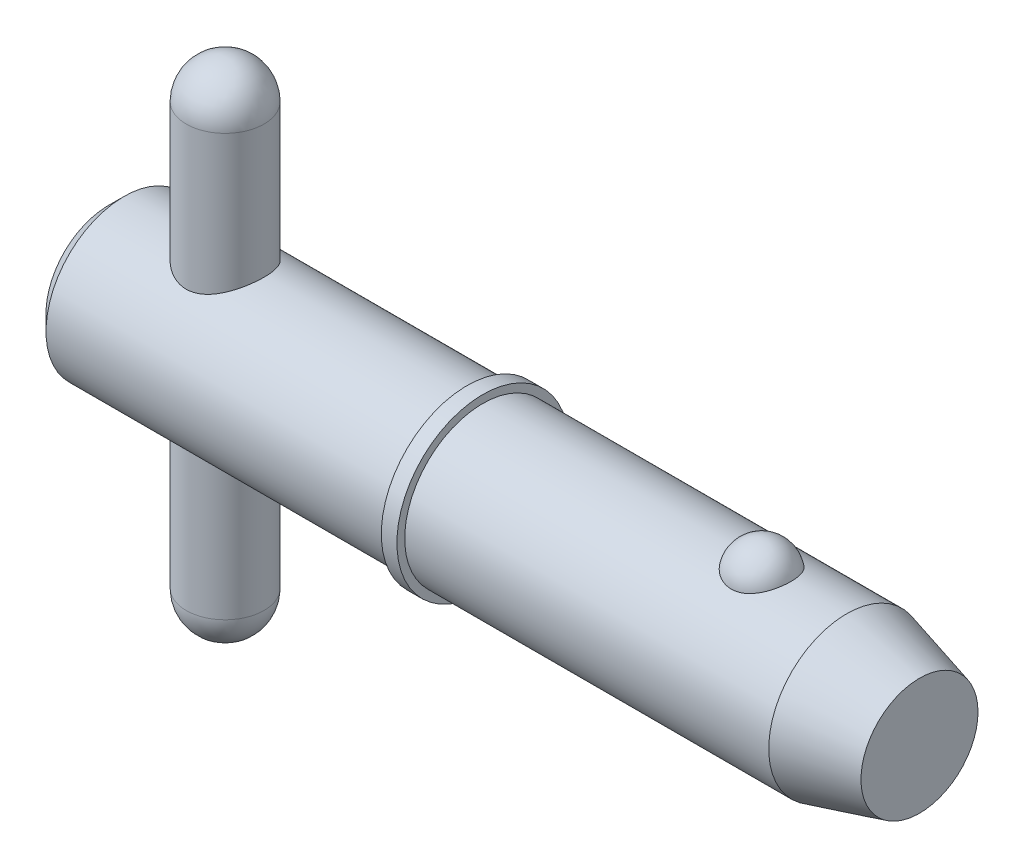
ISO-10303-21;
HEADER;
FILE_DESCRIPTION(('STEP AP214'),'2;1');
FILE_NAME('part.step','',(''),(''),'','','');
FILE_SCHEMA(('AUTOMOTIVE_DESIGN { 1 0 10303 214 1 1 1 1 }'));
ENDSEC;
DATA;
#1=APPLICATION_CONTEXT('core data for automotive mechanical design processes');
#2=APPLICATION_PROTOCOL_DEFINITION('international standard','automotive_design',2000,#1);
#3=PRODUCT_CONTEXT('',#1,'mechanical');
#4=PRODUCT('Part','Part','',(#3));
#5=PRODUCT_RELATED_PRODUCT_CATEGORY('part','',(#4));
#6=PRODUCT_DEFINITION_FORMATION('','',#4);
#7=PRODUCT_DEFINITION_CONTEXT('part definition',#1,'design');
#8=PRODUCT_DEFINITION('design','',#6,#7);
#9=PRODUCT_DEFINITION_SHAPE('','',#8);
#10=(LENGTH_UNIT() NAMED_UNIT(*) SI_UNIT(.MILLI.,.METRE.));
#11=(NAMED_UNIT(*) PLANE_ANGLE_UNIT() SI_UNIT($,.RADIAN.));
#12=(NAMED_UNIT(*) SI_UNIT($,.STERADIAN.) SOLID_ANGLE_UNIT());
#13=UNCERTAINTY_MEASURE_WITH_UNIT(LENGTH_MEASURE(1.E-05),#10,'distance_accuracy_value','');
#14=(GEOMETRIC_REPRESENTATION_CONTEXT(3) GLOBAL_UNCERTAINTY_ASSIGNED_CONTEXT((#13)) GLOBAL_UNIT_ASSIGNED_CONTEXT((#10,
#11,#12)) REPRESENTATION_CONTEXT('',''));
#15=CARTESIAN_POINT('',(0.,0.,0.));
#16=DIRECTION('',(0.,0.,1.));
#17=DIRECTION('',(1.,0.,0.));
#18=AXIS2_PLACEMENT_3D('',#15,#16,#17);
#19=CARTESIAN_POINT('',(5.94,12.7,0.));
#20=DIRECTION('',(0.,-1.,0.));
#21=DIRECTION('',(0.,0.,-1.));
#22=AXIS2_PLACEMENT_3D('',#19,#20,#21);
#23=CYLINDRICAL_SURFACE('',#22,1.98);
#24=CARTESIAN_POINT('',(5.94,-10.72,0.));
#25=DIRECTION('',(0.,-1.,0.));
#26=DIRECTION('',(0.,0.,-1.));
#27=AXIS2_PLACEMENT_3D('',#24,#25,#26);
#28=CIRCLE('',#27,1.98);
#29=CARTESIAN_POINT('',(5.94,-10.72,-1.98));
#30=VERTEX_POINT('',#29);
#31=EDGE_CURVE('P0_E10',#30,#30,#28,.F.);
#32=ORIENTED_EDGE('',*,*,#31,.T.);
#33=EDGE_LOOP('',(#32));
#34=FACE_BOUND('',#33,.T.);
#35=CARTESIAN_POINT('',(5.94,10.72,0.));
#36=DIRECTION('',(0.,-1.,0.));
#37=DIRECTION('',(0.,0.,-1.));
#38=AXIS2_PLACEMENT_3D('',#35,#36,#37);
#39=CIRCLE('',#38,1.98);
#40=CARTESIAN_POINT('',(5.94,10.72,-1.98));
#41=VERTEX_POINT('',#40);
#42=EDGE_CURVE('P0_E21',#41,#41,#39,.T.);
#43=ORIENTED_EDGE('',*,*,#42,.T.);
#44=EDGE_LOOP('',(#43));
#45=FACE_BOUND('',#44,.T.);
#46=ADVANCED_FACE('P0_F14',(#34,#45),#23,.T.);
#47=CARTESIAN_POINT('',(5.94,-10.72,0.));
#48=DIRECTION('',(0.,0.,1.));
#49=DIRECTION('',(1.,0.,0.));
#50=AXIS2_PLACEMENT_3D('',#47,#48,#49);
#51=SPHERICAL_SURFACE('',#50,1.98);
#52=CARTESIAN_POINT('',(5.94,-10.72,0.));
#53=DIRECTION('',(0.,-1.,0.));
#54=DIRECTION('',(0.,0.,-1.));
#55=AXIS2_PLACEMENT_3D('',#52,#53,#54);
#56=SPHERICAL_SURFACE('',#55,1.98);
#57=ORIENTED_EDGE('',*,*,#31,.F.);
#58=EDGE_LOOP('',(#57));
#59=FACE_BOUND('',#58,.T.);
#60=ADVANCED_FACE('P0_F29',(#59),#56,.T.);
#61=CARTESIAN_POINT('',(5.94,10.72,0.));
#62=DIRECTION('',(0.,0.,1.));
#63=DIRECTION('',(1.,0.,0.));
#64=AXIS2_PLACEMENT_3D('',#61,#62,#63);
#65=SPHERICAL_SURFACE('',#64,1.98);
#66=CARTESIAN_POINT('',(5.94,10.72,0.));
#67=DIRECTION('',(0.,-1.,0.));
#68=DIRECTION('',(0.,0.,-1.));
#69=AXIS2_PLACEMENT_3D('',#66,#67,#68);
#70=SPHERICAL_SURFACE('',#69,1.98);
#71=ORIENTED_EDGE('',*,*,#42,.F.);
#72=EDGE_LOOP('',(#71));
#73=FACE_BOUND('',#72,.T.);
#74=ADVANCED_FACE('P0_F16',(#73),#70,.T.);
#75=CLOSED_SHELL('',(#46,#60,#74));
#76=MANIFOLD_SOLID_BREP('P0_B1',#75);
#77=CARTESIAN_POINT('',(0.,0.,0.));
#78=DIRECTION('',(1.,0.,0.));
#79=DIRECTION('',(0.,0.,-1.));
#80=AXIS2_PLACEMENT_3D('',#77,#78,#79);
#81=CYLINDRICAL_SURFACE('',#80,3.97);
#82=CARTESIAN_POINT('',(37.5759395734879,0.,0.));
#83=DIRECTION('',(1.,0.,0.));
#84=DIRECTION('',(0.,0.,-1.));
#85=AXIS2_PLACEMENT_3D('',#82,#83,#84);
#86=CIRCLE('',#85,3.97);
#87=CARTESIAN_POINT('',(37.5759395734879,0.,-3.97));
#88=VERTEX_POINT('',#87);
#89=EDGE_CURVE('P1_E81',#88,#88,#86,.T.);
#90=ORIENTED_EDGE('',*,*,#89,.F.);
#91=EDGE_LOOP('',(#90));
#92=FACE_BOUND('',#91,.T.);
#93=CARTESIAN_POINT('',(19.05,0.,0.));
#94=DIRECTION('',(1.,0.,0.));
#95=DIRECTION('',(0.,0.,-1.));
#96=AXIS2_PLACEMENT_3D('',#93,#94,#95);
#97=CIRCLE('',#96,3.97);
#98=CARTESIAN_POINT('',(19.05,0.,-3.97));
#99=VERTEX_POINT('',#98);
#100=EDGE_CURVE('P1_E85',#99,#99,#97,.T.);
#101=ORIENTED_EDGE('',*,*,#100,.T.);
#102=EDGE_LOOP('',(#101));
#103=FACE_BOUND('',#102,.T.);
#104=CARTESIAN_POINT('',(33.2451922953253,3.65715365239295,1.54470941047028));
#105=CARTESIAN_POINT('',(33.1652448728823,3.65716001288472,1.54470290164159));
#106=CARTESIAN_POINT('',(33.0851650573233,3.65987074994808,1.53832549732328));
#107=CARTESIAN_POINT('',(32.9272374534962,3.6704221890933,1.51297018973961));
#108=CARTESIAN_POINT('',(32.8493961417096,3.67827646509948,1.49395894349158));
#109=CARTESIAN_POINT('',(32.6984614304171,3.69818848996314,1.44395950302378));
#110=CARTESIAN_POINT('',(32.6253560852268,3.71023513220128,1.41300293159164));
#111=CARTESIAN_POINT('',(32.4855630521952,3.7372183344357,1.34000212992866));
#112=CARTESIAN_POINT('',(32.4188725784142,3.75215363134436,1.29796274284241));
#113=CARTESIAN_POINT('',(32.2914886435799,3.78384968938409,1.20248834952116));
#114=CARTESIAN_POINT('',(32.2310299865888,3.80065129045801,1.14875388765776));
#115=CARTESIAN_POINT('',(32.1196942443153,3.83398532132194,1.03205417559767));
#116=CARTESIAN_POINT('',(32.0688200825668,3.85051766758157,0.969086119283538));
#117=CARTESIAN_POINT('',(31.9756321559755,3.88238608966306,0.832526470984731));
#118=CARTESIAN_POINT('',(31.9337961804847,3.89763698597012,0.75858832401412));
#119=CARTESIAN_POINT('',(31.8625108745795,3.92451063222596,0.604352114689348));
#120=CARTESIAN_POINT('',(31.8330623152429,3.93613315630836,0.524053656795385));
#121=CARTESIAN_POINT('',(31.7868927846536,3.95467606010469,0.358403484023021));
#122=CARTESIAN_POINT('',(31.7703127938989,3.96154426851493,0.273006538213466));
#123=CARTESIAN_POINT('',(31.750756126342,3.96967008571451,0.100408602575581));
#124=CARTESIAN_POINT('',(31.7477789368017,3.97092790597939,0.0132076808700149));
#125=CARTESIAN_POINT('',(31.7554587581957,3.96771794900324,-0.159844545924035));
#126=CARTESIAN_POINT('',(31.7660164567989,3.96329187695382,-0.245701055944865));
#127=CARTESIAN_POINT('',(31.8003800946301,3.94923163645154,-0.414277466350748));
#128=CARTESIAN_POINT('',(31.8241862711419,3.93959737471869,-0.496997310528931));
#129=CARTESIAN_POINT('',(31.8846114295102,3.91607752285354,-0.657113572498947));
#130=CARTESIAN_POINT('',(31.9212495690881,3.90218558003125,-0.734501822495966));
#131=CARTESIAN_POINT('',(32.0065935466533,3.87158287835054,-0.881704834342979));
#132=CARTESIAN_POINT('',(32.0553004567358,3.8548718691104,-0.951518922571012));
#133=CARTESIAN_POINT('',(32.1641161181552,3.82028735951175,-1.08208159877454));
#134=CARTESIAN_POINT('',(32.2242955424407,3.80240713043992,-1.14276958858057));
#135=CARTESIAN_POINT('',(32.354493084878,3.76758161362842,-1.2528243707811));
#136=CARTESIAN_POINT('',(32.4245105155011,3.75063626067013,-1.30219195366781));
#137=CARTESIAN_POINT('',(32.57118160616,3.71998948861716,-1.38729709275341));
#138=CARTESIAN_POINT('',(32.6476813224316,3.70623183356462,-1.42327904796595));
#139=CARTESIAN_POINT('',(32.8062981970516,3.68323188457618,-1.48178996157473));
#140=CARTESIAN_POINT('',(32.8884132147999,3.67398788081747,-1.5043240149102));
#141=CARTESIAN_POINT('',(33.0514810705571,3.6615216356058,-1.53440939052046));
#142=CARTESIAN_POINT('',(33.1322840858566,3.65801951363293,-1.54265826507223));
#143=CARTESIAN_POINT('',(33.2942085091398,3.65657341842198,-1.5460842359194));
#144=CARTESIAN_POINT('',(33.3753298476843,3.65862829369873,-1.54126404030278));
#145=CARTESIAN_POINT('',(33.5328122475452,3.66788969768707,-1.51908474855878));
#146=CARTESIAN_POINT('',(33.6092422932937,3.67492621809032,-1.50213925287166));
#147=CARTESIAN_POINT('',(33.7580412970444,3.69318404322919,-1.45666982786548));
#148=CARTESIAN_POINT('',(33.8304099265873,3.70440568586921,-1.42814496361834));
#149=CARTESIAN_POINT('',(33.9708029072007,3.73012749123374,-1.35956319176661));
#150=CARTESIAN_POINT('',(34.0387000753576,3.74469307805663,-1.31927107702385));
#151=CARTESIAN_POINT('',(34.1668649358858,3.77545272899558,-1.22847440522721));
#152=CARTESIAN_POINT('',(34.2271308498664,3.79164717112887,-1.17796747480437));
#153=CARTESIAN_POINT('',(34.3416346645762,3.82490325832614,-1.06519260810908));
#154=CARTESIAN_POINT('',(34.3954137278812,3.84196735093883,-1.00245914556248));
#155=CARTESIAN_POINT('',(34.4920988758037,3.87439863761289,-0.868715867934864));
#156=CARTESIAN_POINT('',(34.5350030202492,3.88976552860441,-0.797704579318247));
#157=CARTESIAN_POINT('',(34.610266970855,3.91771381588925,-0.646896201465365));
#158=CARTESIAN_POINT('',(34.6422532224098,3.93019255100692,-0.566893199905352));
#159=CARTESIAN_POINT('',(34.6931101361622,3.95043886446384,-0.40225513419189));
#160=CARTESIAN_POINT('',(34.7119807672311,3.95820643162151,-0.317620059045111));
#161=CARTESIAN_POINT('',(34.7362162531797,3.96823733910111,-0.14615699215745));
#162=CARTESIAN_POINT('',(34.7415874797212,3.970503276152,-0.0593300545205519));
#163=CARTESIAN_POINT('',(34.7387309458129,3.96930811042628,0.114057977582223));
#164=CARTESIAN_POINT('',(34.7305035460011,3.9658471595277,0.200619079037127));
#165=CARTESIAN_POINT('',(34.7007063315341,3.95358562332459,0.370506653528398));
#166=CARTESIAN_POINT('',(34.6792129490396,3.94481563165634,0.453848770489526));
#167=CARTESIAN_POINT('',(34.6233839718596,3.92284586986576,0.615497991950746));
#168=CARTESIAN_POINT('',(34.5890474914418,3.90964579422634,0.693804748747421));
#169=CARTESIAN_POINT('',(34.5079702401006,3.88006987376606,0.843703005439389));
#170=CARTESIAN_POINT('',(34.4611536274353,3.86367478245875,0.915249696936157));
#171=CARTESIAN_POINT('',(34.3561897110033,3.82949741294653,1.04910810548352));
#172=CARTESIAN_POINT('',(34.2980428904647,3.81171519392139,1.11142021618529));
#173=CARTESIAN_POINT('',(34.1717433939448,3.77673366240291,1.22503948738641));
#174=CARTESIAN_POINT('',(34.1035970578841,3.75953398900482,1.27635357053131));
#175=CARTESIAN_POINT('',(33.9589009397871,3.72770506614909,1.36653336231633));
#176=CARTESIAN_POINT('',(33.882348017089,3.71307678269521,1.40539439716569));
#177=CARTESIAN_POINT('',(33.7257594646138,3.68864287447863,1.46830480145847));
#178=CARTESIAN_POINT('',(33.6459307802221,3.67869017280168,1.49281289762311));
#179=CARTESIAN_POINT('',(33.4829877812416,3.66414535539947,1.52817474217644));
#180=CARTESIAN_POINT('',(33.3998840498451,3.65953723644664,1.53906926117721));
#181=CARTESIAN_POINT('',(33.2927760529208,3.6573894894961,1.54414878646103));
#182=CARTESIAN_POINT('',(33.2689900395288,3.65715175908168,1.54471134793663));
#183=CARTESIAN_POINT('',(33.2451922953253,3.65715365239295,1.54470941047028));
#184=B_SPLINE_CURVE_WITH_KNOTS('',3,(#104,#105,#106,#107,#108,#109,#110,#111,#112,#113,#114,
#115,#116,#117,#118,#119,#120,#121,#122,#123,#124,#125,#126,#127,#128,#129,#130,#131,#132,#133,
#134,#135,#136,#137,#138,#139,#140,#141,#142,#143,#144,#145,#146,#147,#148,#149,#150,#151,#152,
#153,#154,#155,#156,#157,#158,#159,#160,#161,#162,#163,#164,#165,#166,#167,#168,#169,#170,#171,
#172,#173,#174,#175,#176,#177,#178,#179,#180,#181,#182,#183),.UNSPECIFIED.,.T.,.F.,(4,2,2,2,2,2,
2,2,2,2,2,2,2,2,2,2,2,2,2,2,2,2,2,2,2,2,2,2,2,2,2,2,2,2,2,2,2,2,2,4),(0.,0.239777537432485,
0.480190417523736,0.719971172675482,0.959647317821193,1.20639040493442,1.45320863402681,
1.7109367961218,1.96868099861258,2.22921052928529,2.48973023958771,2.74834928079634,
3.00697295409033,3.26598440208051,3.52501886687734,3.78570385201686,4.04637062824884,
4.30201257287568,4.55755760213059,4.80022994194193,5.04285200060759,5.27757006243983,
5.51230707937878,5.75210128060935,5.99195126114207,6.24392810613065,6.49594987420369,
6.75588818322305,7.01582710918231,7.27564332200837,7.53545264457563,7.79377886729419,
8.0521229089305,8.31207418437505,8.57201437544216,8.83179046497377,9.09166393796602,
9.34270057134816,9.59298357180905,9.66435753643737),.UNSPECIFIED.);
#185=CARTESIAN_POINT('',(33.2451922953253,3.65715365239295,1.54470941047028));
#186=VERTEX_POINT('',#185);
#187=EDGE_CURVE('P1_E35',#186,#186,#184,.T.);
#188=ORIENTED_EDGE('',*,*,#187,.T.);
#189=EDGE_LOOP('',(#188));
#190=FACE_BOUND('',#189,.T.);
#191=ADVANCED_FACE('P1_F13',(#92,#103,#190),#81,.T.);
#192=CARTESIAN_POINT('',(0.,0.,0.));
#193=DIRECTION('',(-1.,0.,0.));
#194=DIRECTION('',(0.,0.,1.));
#195=AXIS2_PLACEMENT_3D('',#192,#193,#194);
#196=PLANE('',#195);
#197=CARTESIAN_POINT('',(0.,0.,0.));
#198=DIRECTION('',(1.,0.,0.));
#199=DIRECTION('',(0.,0.,-1.));
#200=AXIS2_PLACEMENT_3D('',#197,#198,#199);
#201=CIRCLE('',#200,3.176);
#202=CARTESIAN_POINT('',(0.,0.,-3.176));
#203=VERTEX_POINT('',#202);
#204=EDGE_CURVE('P1_E9',#203,#203,#201,.T.);
#205=ORIENTED_EDGE('',*,*,#204,.F.);
#206=EDGE_LOOP('',(#205));
#207=FACE_BOUND('',#206,.T.);
#208=ADVANCED_FACE('P1_F15',(#207),#196,.T.);
#209=CARTESIAN_POINT('',(0.793999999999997,0.,0.));
#210=DIRECTION('',(1.,0.,0.));
#211=DIRECTION('',(0.,0.,-1.));
#212=AXIS2_PLACEMENT_3D('',#209,#210,#211);
#213=CONICAL_SURFACE('',#212,3.97,0.78539816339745);
#214=ORIENTED_EDGE('',*,*,#204,.T.);
#215=EDGE_LOOP('',(#214));
#216=FACE_BOUND('',#215,.T.);
#217=CARTESIAN_POINT('',(0.793999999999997,0.,0.));
#218=DIRECTION('',(1.,0.,0.));
#219=DIRECTION('',(0.,0.,-1.));
#220=AXIS2_PLACEMENT_3D('',#217,#218,#219);
#221=CIRCLE('',#220,3.97);
#222=CARTESIAN_POINT('',(0.793999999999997,0.,-3.97));
#223=VERTEX_POINT('',#222);
#224=EDGE_CURVE('P1_E26',#223,#223,#221,.T.);
#225=ORIENTED_EDGE('',*,*,#224,.F.);
#226=EDGE_LOOP('',(#225));
#227=FACE_BOUND('',#226,.T.);
#228=ADVANCED_FACE('P1_F77',(#216,#227),#213,.T.);
#229=CARTESIAN_POINT('',(0.,0.,0.));
#230=DIRECTION('',(1.,0.,0.));
#231=DIRECTION('',(0.,0.,-1.));
#232=AXIS2_PLACEMENT_3D('',#229,#230,#231);
#233=CYLINDRICAL_SURFACE('',#232,3.97);
#234=CARTESIAN_POINT('',(5.94,-3.44100276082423,1.98));
#235=CARTESIAN_POINT('',(5.8367885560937,-3.44101282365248,1.97999171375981));
#236=CARTESIAN_POINT('',(5.73344176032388,-3.44571749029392,1.97187534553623));
#237=CARTESIAN_POINT('',(5.52991905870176,-3.46385873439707,1.93981946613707));
#238=CARTESIAN_POINT('',(5.42975031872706,-3.47731375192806,1.91584653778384));
#239=CARTESIAN_POINT('',(5.23590869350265,-3.51100678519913,1.85336773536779));
#240=CARTESIAN_POINT('',(5.14220446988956,-3.53120882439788,1.81493880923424));
#241=CARTESIAN_POINT('',(4.9625969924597,-3.57606420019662,1.72487335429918));
#242=CARTESIAN_POINT('',(4.87669412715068,-3.6007177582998,1.67323616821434));
#243=CARTESIAN_POINT('',(4.70734412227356,-3.65417020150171,1.55325205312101));
#244=CARTESIAN_POINT('',(4.62467662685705,-3.68314323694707,1.4838818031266));
#245=CARTESIAN_POINT('',(4.47154355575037,-3.74056406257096,1.33252902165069));
#246=CARTESIAN_POINT('',(4.40108404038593,-3.76901158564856,1.25054026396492));
#247=CARTESIAN_POINT('',(4.26974803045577,-3.82445556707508,1.06956584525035));
#248=CARTESIAN_POINT('',(4.20982960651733,-3.8512271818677,0.969809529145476));
#249=CARTESIAN_POINT('',(4.10798077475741,-3.89804342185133,0.760047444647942));
#250=CARTESIAN_POINT('',(4.06603907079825,-3.91809226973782,0.650048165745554));
#251=CARTESIAN_POINT('',(4.00441878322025,-3.94794912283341,0.431181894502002));
#252=CARTESIAN_POINT('',(3.98337329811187,-3.95838209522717,0.322786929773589));
#253=CARTESIAN_POINT('',(3.9596425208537,-3.97016407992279,0.103541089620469));
#254=CARTESIAN_POINT('',(3.95694618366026,-3.97151855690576,-0.00730826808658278));
#255=CARTESIAN_POINT('',(3.9694599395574,-3.96528826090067,-0.218044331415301));
#256=CARTESIAN_POINT('',(3.98314071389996,-3.95846689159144,-0.318049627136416));
#257=CARTESIAN_POINT('',(4.02528522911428,-3.93780347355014,-0.514124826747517));
#258=CARTESIAN_POINT('',(4.05375007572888,-3.92396089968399,-0.61019443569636));
#259=CARTESIAN_POINT('',(4.12484256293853,-3.89028355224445,-0.797351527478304));
#260=CARTESIAN_POINT('',(4.16766142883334,-3.87036821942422,-0.888351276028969));
#261=CARTESIAN_POINT('',(4.26598377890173,-3.82634285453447,-1.06209448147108));
#262=CARTESIAN_POINT('',(4.32149181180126,-3.8022313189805,-1.14483496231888));
#263=CARTESIAN_POINT('',(4.44962332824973,-3.74940011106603,-1.30802500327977));
#264=CARTESIAN_POINT('',(4.52336636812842,-3.72046031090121,-1.38752498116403));
#265=CARTESIAN_POINT('',(4.68287656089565,-3.66269463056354,-1.53354043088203));
#266=CARTESIAN_POINT('',(4.7686527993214,-3.63386885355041,-1.60004599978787));
#267=CARTESIAN_POINT('',(4.9564069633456,-3.57763161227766,-1.72228426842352));
#268=CARTESIAN_POINT('',(5.05906485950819,-3.5504233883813,-1.77707534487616));
#269=CARTESIAN_POINT('',(5.27381412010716,-3.50334038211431,-1.86819784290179));
#270=CARTESIAN_POINT('',(5.38589553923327,-3.48345798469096,-1.90454844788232));
#271=CARTESIAN_POINT('',(5.6069795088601,-3.45548331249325,-1.95481643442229));
#272=CARTESIAN_POINT('',(5.71552407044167,-3.44658268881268,-1.97028113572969));
#273=CARTESIAN_POINT('',(5.93399639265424,-3.43928114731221,-1.98300600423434));
#274=CARTESIAN_POINT('',(6.04392313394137,-3.44087289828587,-1.98027888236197));
#275=CARTESIAN_POINT('',(6.24931618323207,-3.45351901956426,-1.95811780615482));
#276=CARTESIAN_POINT('',(6.34505668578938,-3.46352725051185,-1.94052989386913));
#277=CARTESIAN_POINT('',(6.53204702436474,-3.49033612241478,-1.89188242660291));
#278=CARTESIAN_POINT('',(6.62329540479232,-3.50713894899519,-1.86081853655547));
#279=CARTESIAN_POINT('',(6.80352105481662,-3.54655680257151,-1.78458666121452));
#280=CARTESIAN_POINT('',(6.89219712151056,-3.56940508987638,-1.73883178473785));
#281=CARTESIAN_POINT('',(7.06112449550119,-3.61813012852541,-1.63502913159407));
#282=CARTESIAN_POINT('',(7.14137144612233,-3.6440084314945,-1.57697504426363));
#283=CARTESIAN_POINT('',(7.30168083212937,-3.69977514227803,-1.44171920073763));
#284=CARTESIAN_POINT('',(7.38046039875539,-3.7297597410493,-1.36302972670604));
#285=CARTESIAN_POINT('',(7.52409649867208,-3.78754991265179,-1.19307190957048));
#286=CARTESIAN_POINT('',(7.58894840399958,-3.81535475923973,-1.10179940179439));
#287=CARTESIAN_POINT('',(7.70430122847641,-3.86658972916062,-0.906019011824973));
#288=CARTESIAN_POINT('',(7.75438714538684,-3.88988795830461,-0.801229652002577));
#289=CARTESIAN_POINT('',(7.83572184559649,-3.92848199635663,-0.583216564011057));
#290=CARTESIAN_POINT('',(7.86698708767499,-3.94378479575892,-0.470000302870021));
#291=CARTESIAN_POINT('',(7.90711051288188,-3.96355307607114,-0.249525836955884));
#292=CARTESIAN_POINT('',(7.91775648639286,-3.96888171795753,-0.142669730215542));
#293=CARTESIAN_POINT('',(7.92160247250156,-3.97079858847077,0.0714191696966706));
#294=CARTESIAN_POINT('',(7.91480852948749,-3.96738984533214,0.178651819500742));
#295=CARTESIAN_POINT('',(7.88515479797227,-3.9527181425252,0.383072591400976));
#296=CARTESIAN_POINT('',(7.8633739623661,-3.94198303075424,0.480459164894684));
#297=CARTESIAN_POINT('',(7.80581513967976,-3.91422178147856,0.670038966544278));
#298=CARTESIAN_POINT('',(7.77003513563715,-3.89719473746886,0.762231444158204));
#299=CARTESIAN_POINT('',(7.68389191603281,-3.85747818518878,0.943248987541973));
#300=CARTESIAN_POINT('',(7.63296879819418,-3.83457704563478,1.03175978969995));
#301=CARTESIAN_POINT('',(7.51869140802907,-3.7855122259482,1.19934744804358));
#302=CARTESIAN_POINT('',(7.45533142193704,-3.75934704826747,1.2784199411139));
#303=CARTESIAN_POINT('',(7.31068939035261,-3.70329841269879,1.433144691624));
#304=CARTESIAN_POINT('',(7.22825362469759,-3.67330340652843,1.50768183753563));
#305=CARTESIAN_POINT('',(7.05162367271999,-3.61514025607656,1.64226879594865));
#306=CARTESIAN_POINT('',(6.95741928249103,-3.58697372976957,1.70230590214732));
#307=CARTESIAN_POINT('',(6.75590859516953,-3.53504049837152,1.80775364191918));
#308=CARTESIAN_POINT('',(6.64828786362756,-3.51143624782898,1.85265616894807));
#309=CARTESIAN_POINT('',(6.48137774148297,-3.48289659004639,1.90544537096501));
#310=CARTESIAN_POINT('',(6.42488151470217,-3.4745323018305,1.9206071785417));
#311=CARTESIAN_POINT('',(6.31046920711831,-3.4604244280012,1.94591259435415));
#312=CARTESIAN_POINT('',(6.25255415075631,-3.45467900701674,1.95605971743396));
#313=CARTESIAN_POINT('',(6.1521444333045,-3.44728060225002,1.96905939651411));
#314=CARTESIAN_POINT('',(6.10985721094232,-3.44493297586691,1.97315742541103));
#315=CARTESIAN_POINT('',(6.02505433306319,-3.44179192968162,1.97862952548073));
#316=CARTESIAN_POINT('',(5.98253866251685,-3.44099861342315,1.98000341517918));
#317=CARTESIAN_POINT('',(5.94,-3.44100276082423,1.98));
#318=B_SPLINE_CURVE_WITH_KNOTS('',3,(#234,#235,#236,#237,#238,#239,#240,#241,#242,#243,#244,
#245,#246,#247,#248,#249,#250,#251,#252,#253,#254,#255,#256,#257,#258,#259,#260,#261,#262,#263,
#264,#265,#266,#267,#268,#269,#270,#271,#272,#273,#274,#275,#276,#277,#278,#279,#280,#281,#282,
#283,#284,#285,#286,#287,#288,#289,#290,#291,#292,#293,#294,#295,#296,#297,#298,#299,#300,#301,
#302,#303,#304,#305,#306,#307,#308,#309,#310,#311,#312,#313,#314,#315,#316,#317),.UNSPECIFIED.,
.T.,.F.,(4,2,2,2,2,2,2,2,2,2,2,2,2,2,2,2,2,2,2,2,2,2,2,2,2,2,2,2,2,2,2,2,2,2,2,2,2,2,2,2,2,4),
(0.,0.309462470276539,0.619579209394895,0.928068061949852,1.23657226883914,1.57038619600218,
1.90436536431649,2.26071614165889,2.61684266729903,2.94773555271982,3.27842924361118,
3.58050679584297,3.88260694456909,4.18890317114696,4.49530936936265,4.83057163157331,
5.1660884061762,5.52272472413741,5.87898927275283,6.20706708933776,6.53491569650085,
6.82716910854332,7.11951660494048,7.42541184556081,7.73146442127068,8.07586334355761,
8.42037652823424,8.77380887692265,9.12693169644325,9.44775848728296,9.76847409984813,
10.0682302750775,10.3680296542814,10.6806938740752,10.9935020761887,11.3373031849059,
11.6814044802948,12.0361164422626,12.2131519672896,12.3900632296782,12.5175998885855,
12.6451450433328),.UNSPECIFIED.);
#319=CARTESIAN_POINT('',(5.94,-3.44100276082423,1.98));
#320=VERTEX_POINT('',#319);
#321=EDGE_CURVE('P1_E17',#320,#320,#318,.T.);
#322=ORIENTED_EDGE('',*,*,#321,.F.);
#323=EDGE_LOOP('',(#322));
#324=FACE_BOUND('',#323,.T.);
#325=CARTESIAN_POINT('',(5.94,3.44100276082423,1.98));
#326=CARTESIAN_POINT('',(6.0432114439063,3.44101282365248,1.97999171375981));
#327=CARTESIAN_POINT('',(6.14655823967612,3.44571749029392,1.97187534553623));
#328=CARTESIAN_POINT('',(6.35008094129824,3.46385873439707,1.93981946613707));
#329=CARTESIAN_POINT('',(6.45024968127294,3.47731375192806,1.91584653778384));
#330=CARTESIAN_POINT('',(6.64409130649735,3.51100678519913,1.85336773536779));
#331=CARTESIAN_POINT('',(6.73779553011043,3.53120882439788,1.81493880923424));
#332=CARTESIAN_POINT('',(6.91740300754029,3.57606420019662,1.72487335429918));
#333=CARTESIAN_POINT('',(7.00330587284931,3.6007177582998,1.67323616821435));
#334=CARTESIAN_POINT('',(7.17265587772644,3.65417020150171,1.55325205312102));
#335=CARTESIAN_POINT('',(7.25532337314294,3.68314323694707,1.4838818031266));
#336=CARTESIAN_POINT('',(7.40845644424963,3.74056406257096,1.3325290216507));
#337=CARTESIAN_POINT('',(7.47891595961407,3.76901158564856,1.25054026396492));
#338=CARTESIAN_POINT('',(7.61025196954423,3.82445556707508,1.06956584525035));
#339=CARTESIAN_POINT('',(7.67017039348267,3.8512271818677,0.969809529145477));
#340=CARTESIAN_POINT('',(7.77201922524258,3.89804342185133,0.760047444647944));
#341=CARTESIAN_POINT('',(7.81396092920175,3.91809226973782,0.650048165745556));
#342=CARTESIAN_POINT('',(7.87558121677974,3.94794912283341,0.431181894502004));
#343=CARTESIAN_POINT('',(7.89662670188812,3.95838209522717,0.322786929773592));
#344=CARTESIAN_POINT('',(7.9203574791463,3.97016407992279,0.103541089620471));
#345=CARTESIAN_POINT('',(7.92305381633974,3.97151855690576,-0.00730826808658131));
#346=CARTESIAN_POINT('',(7.9105400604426,3.96528826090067,-0.2180443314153));
#347=CARTESIAN_POINT('',(7.89685928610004,3.95846689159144,-0.318049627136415));
#348=CARTESIAN_POINT('',(7.85471477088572,3.93780347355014,-0.514124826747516));
#349=CARTESIAN_POINT('',(7.82624992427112,3.92396089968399,-0.61019443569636));
#350=CARTESIAN_POINT('',(7.75515743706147,3.89028355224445,-0.797351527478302));
#351=CARTESIAN_POINT('',(7.71233857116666,3.87036821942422,-0.888351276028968));
#352=CARTESIAN_POINT('',(7.61401622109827,3.82634285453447,-1.06209448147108));
#353=CARTESIAN_POINT('',(7.55850818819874,3.8022313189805,-1.14483496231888));
#354=CARTESIAN_POINT('',(7.43037667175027,3.74940011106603,-1.30802500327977));
#355=CARTESIAN_POINT('',(7.35663363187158,3.72046031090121,-1.38752498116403));
#356=CARTESIAN_POINT('',(7.19712343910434,3.66269463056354,-1.53354043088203));
#357=CARTESIAN_POINT('',(7.1113472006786,3.63386885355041,-1.60004599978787));
#358=CARTESIAN_POINT('',(6.9235930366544,3.57763161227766,-1.72228426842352));
#359=CARTESIAN_POINT('',(6.82093514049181,3.5504233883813,-1.77707534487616));
#360=CARTESIAN_POINT('',(6.60618587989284,3.50334038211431,-1.86819784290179));
#361=CARTESIAN_POINT('',(6.49410446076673,3.48345798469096,-1.90454844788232));
#362=CARTESIAN_POINT('',(6.2730204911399,3.45548331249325,-1.95481643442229));
#363=CARTESIAN_POINT('',(6.16447592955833,3.44658268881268,-1.97028113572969));
#364=CARTESIAN_POINT('',(5.94600360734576,3.43928114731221,-1.98300600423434));
#365=CARTESIAN_POINT('',(5.83607686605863,3.44087289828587,-1.98027888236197));
#366=CARTESIAN_POINT('',(5.63068381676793,3.45351901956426,-1.95811780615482));
#367=CARTESIAN_POINT('',(5.53494331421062,3.46352725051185,-1.94052989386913));
#368=CARTESIAN_POINT('',(5.34795297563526,3.49033612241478,-1.89188242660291));
#369=CARTESIAN_POINT('',(5.25670459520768,3.50713894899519,-1.86081853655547));
#370=CARTESIAN_POINT('',(5.07647894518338,3.54655680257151,-1.78458666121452));
#371=CARTESIAN_POINT('',(4.98780287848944,3.56940508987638,-1.73883178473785));
#372=CARTESIAN_POINT('',(4.81887550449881,3.61813012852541,-1.63502913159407));
#373=CARTESIAN_POINT('',(4.73862855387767,3.6440084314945,-1.57697504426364));
#374=CARTESIAN_POINT('',(4.57831916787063,3.69977514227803,-1.44171920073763));
#375=CARTESIAN_POINT('',(4.49953960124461,3.7297597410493,-1.36302972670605));
#376=CARTESIAN_POINT('',(4.35590350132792,3.78754991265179,-1.19307190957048));
#377=CARTESIAN_POINT('',(4.29105159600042,3.81535475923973,-1.10179940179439));
#378=CARTESIAN_POINT('',(4.17569877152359,3.86658972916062,-0.906019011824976));
#379=CARTESIAN_POINT('',(4.12561285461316,3.88988795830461,-0.80122965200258));
#380=CARTESIAN_POINT('',(4.04427815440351,3.92848199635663,-0.58321656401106));
#381=CARTESIAN_POINT('',(4.01301291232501,3.94378479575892,-0.470000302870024));
#382=CARTESIAN_POINT('',(3.97288948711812,3.96355307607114,-0.249525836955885));
#383=CARTESIAN_POINT('',(3.96224351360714,3.96888171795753,-0.142669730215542));
#384=CARTESIAN_POINT('',(3.95839752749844,3.97079858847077,0.0714191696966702));
#385=CARTESIAN_POINT('',(3.96519147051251,3.96738984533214,0.178651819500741));
#386=CARTESIAN_POINT('',(3.99484520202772,3.9527181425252,0.383072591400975));
#387=CARTESIAN_POINT('',(4.01662603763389,3.94198303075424,0.480459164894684));
#388=CARTESIAN_POINT('',(4.07418486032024,3.91422178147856,0.670038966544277));
#389=CARTESIAN_POINT('',(4.10996486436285,3.89719473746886,0.762231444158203));
#390=CARTESIAN_POINT('',(4.19610808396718,3.85747818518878,0.943248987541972));
#391=CARTESIAN_POINT('',(4.24703120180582,3.83457704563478,1.03175978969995));
#392=CARTESIAN_POINT('',(4.36130859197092,3.7855122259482,1.19934744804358));
#393=CARTESIAN_POINT('',(4.42466857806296,3.75934704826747,1.2784199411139));
#394=CARTESIAN_POINT('',(4.56931060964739,3.70329841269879,1.433144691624));
#395=CARTESIAN_POINT('',(4.65174637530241,3.67330340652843,1.50768183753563));
#396=CARTESIAN_POINT('',(4.82837632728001,3.61514025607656,1.64226879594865));
#397=CARTESIAN_POINT('',(4.92258071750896,3.58697372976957,1.70230590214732));
#398=CARTESIAN_POINT('',(5.12409140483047,3.53504049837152,1.80775364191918));
#399=CARTESIAN_POINT('',(5.23171213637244,3.51143624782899,1.85265616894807));
#400=CARTESIAN_POINT('',(5.39862225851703,3.48289659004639,1.90544537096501));
#401=CARTESIAN_POINT('',(5.45511848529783,3.4745323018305,1.9206071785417));
#402=CARTESIAN_POINT('',(5.56953079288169,3.4604244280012,1.94591259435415));
#403=CARTESIAN_POINT('',(5.62744584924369,3.45467900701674,1.95605971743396));
#404=CARTESIAN_POINT('',(5.7278555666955,3.44728060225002,1.9690593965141));
#405=CARTESIAN_POINT('',(5.77014278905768,3.44493297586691,1.97315742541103));
#406=CARTESIAN_POINT('',(5.85494566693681,3.44179192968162,1.97862952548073));
#407=CARTESIAN_POINT('',(5.89746133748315,3.44099861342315,1.98000341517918));
#408=CARTESIAN_POINT('',(5.94,3.44100276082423,1.98));
#409=B_SPLINE_CURVE_WITH_KNOTS('',3,(#325,#326,#327,#328,#329,#330,#331,#332,#333,#334,#335,
#336,#337,#338,#339,#340,#341,#342,#343,#344,#345,#346,#347,#348,#349,#350,#351,#352,#353,#354,
#355,#356,#357,#358,#359,#360,#361,#362,#363,#364,#365,#366,#367,#368,#369,#370,#371,#372,#373,
#374,#375,#376,#377,#378,#379,#380,#381,#382,#383,#384,#385,#386,#387,#388,#389,#390,#391,#392,
#393,#394,#395,#396,#397,#398,#399,#400,#401,#402,#403,#404,#405,#406,#407,#408),.UNSPECIFIED.,
.T.,.F.,(4,2,2,2,2,2,2,2,2,2,2,2,2,2,2,2,2,2,2,2,2,2,2,2,2,2,2,2,2,2,2,2,2,2,2,2,2,2,2,2,2,4),
(0.,0.309462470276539,0.619579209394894,0.928068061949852,1.23657226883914,1.57038619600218,
1.90436536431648,2.26071614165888,2.61684266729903,2.94773555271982,3.27842924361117,
3.58050679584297,3.88260694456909,4.18890317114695,4.49530936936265,4.83057163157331,
5.1660884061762,5.5227247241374,5.87898927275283,6.20706708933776,6.53491569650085,
6.82716910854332,7.11951660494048,7.42541184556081,7.73146442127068,8.07586334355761,
8.42037652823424,8.77380887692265,9.12693169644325,9.44775848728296,9.76847409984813,
10.0682302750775,10.3680296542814,10.6806938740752,10.9935020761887,11.3373031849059,
11.6814044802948,12.0361164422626,12.2131519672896,12.3900632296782,12.5175998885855,
12.6451450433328),.UNSPECIFIED.);
#410=CARTESIAN_POINT('',(5.94,3.44100276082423,1.98));
#411=VERTEX_POINT('',#410);
#412=EDGE_CURVE('P1_E43',#411,#411,#409,.T.);
#413=ORIENTED_EDGE('',*,*,#412,.F.);
#414=EDGE_LOOP('',(#413));
#415=FACE_BOUND('',#414,.T.);
#416=ORIENTED_EDGE('',*,*,#224,.T.);
#417=EDGE_LOOP('',(#416));
#418=FACE_BOUND('',#417,.T.);
#419=CARTESIAN_POINT('',(18.256,0.,0.));
#420=DIRECTION('',(1.,0.,0.));
#421=DIRECTION('',(0.,0.,-1.));
#422=AXIS2_PLACEMENT_3D('',#419,#420,#421);
#423=CIRCLE('',#422,3.97);
#424=CARTESIAN_POINT('',(18.256,0.,-3.97));
#425=VERTEX_POINT('',#424);
#426=EDGE_CURVE('P1_E31',#425,#425,#423,.T.);
#427=ORIENTED_EDGE('',*,*,#426,.F.);
#428=EDGE_LOOP('',(#427));
#429=FACE_BOUND('',#428,.T.);
#430=ADVANCED_FACE('P1_F103',(#324,#415,#418,#429),#233,.T.);
#431=CARTESIAN_POINT('',(18.256,3.97,0.));
#432=DIRECTION('',(-1.,0.,0.));
#433=DIRECTION('',(0.,0.,1.));
#434=AXIS2_PLACEMENT_3D('',#431,#432,#433);
#435=PLANE('',#434);
#436=ORIENTED_EDGE('',*,*,#426,.T.);
#437=EDGE_LOOP('',(#436));
#438=FACE_BOUND('',#437,.T.);
#439=CARTESIAN_POINT('',(18.256,0.,0.));
#440=DIRECTION('',(1.,0.,0.));
#441=DIRECTION('',(0.,0.,-1.));
#442=AXIS2_PLACEMENT_3D('',#439,#440,#441);
#443=CIRCLE('',#442,4.367);
#444=CARTESIAN_POINT('',(18.256,0.,-4.367));
#445=VERTEX_POINT('',#444);
#446=EDGE_CURVE('P1_E91',#445,#445,#443,.T.);
#447=ORIENTED_EDGE('',*,*,#446,.F.);
#448=EDGE_LOOP('',(#447));
#449=FACE_BOUND('',#448,.T.);
#450=ADVANCED_FACE('P1_F100',(#438,#449),#435,.T.);
#451=CARTESIAN_POINT('',(0.,0.,0.));
#452=DIRECTION('',(1.,0.,0.));
#453=DIRECTION('',(0.,0.,-1.));
#454=AXIS2_PLACEMENT_3D('',#451,#452,#453);
#455=CYLINDRICAL_SURFACE('',#454,4.367);
#456=ORIENTED_EDGE('',*,*,#446,.T.);
#457=EDGE_LOOP('',(#456));
#458=FACE_BOUND('',#457,.T.);
#459=CARTESIAN_POINT('',(19.05,0.,0.));
#460=DIRECTION('',(1.,0.,0.));
#461=DIRECTION('',(0.,0.,-1.));
#462=AXIS2_PLACEMENT_3D('',#459,#460,#461);
#463=CIRCLE('',#462,4.367);
#464=CARTESIAN_POINT('',(19.05,0.,-4.367));
#465=VERTEX_POINT('',#464);
#466=EDGE_CURVE('P1_E88',#465,#465,#463,.T.);
#467=ORIENTED_EDGE('',*,*,#466,.F.);
#468=EDGE_LOOP('',(#467));
#469=FACE_BOUND('',#468,.T.);
#470=ADVANCED_FACE('P1_F68',(#458,#469),#455,.T.);
#471=CARTESIAN_POINT('',(19.05,4.367,0.));
#472=DIRECTION('',(1.,0.,0.));
#473=DIRECTION('',(0.,0.,-1.));
#474=AXIS2_PLACEMENT_3D('',#471,#472,#473);
#475=PLANE('',#474);
#476=ORIENTED_EDGE('',*,*,#466,.T.);
#477=EDGE_LOOP('',(#476));
#478=FACE_BOUND('',#477,.T.);
#479=ORIENTED_EDGE('',*,*,#100,.F.);
#480=EDGE_LOOP('',(#479));
#481=FACE_BOUND('',#480,.T.);
#482=ADVANCED_FACE('P1_F62',(#478,#481),#475,.T.);
#483=CARTESIAN_POINT('',(41.28,0.,0.));
#484=DIRECTION('',(-1.,0.,0.));
#485=DIRECTION('',(0.,0.,1.));
#486=AXIS2_PLACEMENT_3D('',#483,#484,#485);
#487=CONICAL_SURFACE('',#486,2.97750000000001,0.26179938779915);
#488=ORIENTED_EDGE('',*,*,#89,.T.);
#489=EDGE_LOOP('',(#488));
#490=FACE_BOUND('',#489,.T.);
#491=CARTESIAN_POINT('',(41.28,0.,0.));
#492=DIRECTION('',(1.,0.,0.));
#493=DIRECTION('',(0.,0.,-1.));
#494=AXIS2_PLACEMENT_3D('',#491,#492,#493);
#495=CIRCLE('',#494,2.97750000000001);
#496=CARTESIAN_POINT('',(41.28,0.,-2.97750000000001));
#497=VERTEX_POINT('',#496);
#498=EDGE_CURVE('P1_E42',#497,#497,#495,.T.);
#499=ORIENTED_EDGE('',*,*,#498,.F.);
#500=EDGE_LOOP('',(#499));
#501=FACE_BOUND('',#500,.T.);
#502=ADVANCED_FACE('P1_F59',(#490,#501),#487,.T.);
#503=CARTESIAN_POINT('',(41.28,2.97750000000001,0.));
#504=DIRECTION('',(1.,0.,0.));
#505=DIRECTION('',(0.,0.,-1.));
#506=AXIS2_PLACEMENT_3D('',#503,#504,#505);
#507=PLANE('',#506);
#508=ORIENTED_EDGE('',*,*,#498,.T.);
#509=EDGE_LOOP('',(#508));
#510=FACE_BOUND('',#509,.T.);
#511=ADVANCED_FACE('P1_F55',(#510),#507,.T.);
#512=CARTESIAN_POINT('',(33.2451922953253,3.573,0.));
#513=DIRECTION('',(-1.,0.,0.));
#514=DIRECTION('',(0.,1.,0.));
#515=AXIS2_PLACEMENT_3D('',#512,#513,#514);
#516=SPHERICAL_SURFACE('',#515,1.54699999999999);
#517=ORIENTED_EDGE('',*,*,#187,.F.);
#518=EDGE_LOOP('',(#517));
#519=FACE_BOUND('',#518,.T.);
#520=ADVANCED_FACE('P1_F50',(#519),#516,.T.);
#521=CARTESIAN_POINT('',(5.94,-4.367,0.));
#522=DIRECTION('',(0.,1.,0.));
#523=DIRECTION('',(0.,0.,1.));
#524=AXIS2_PLACEMENT_3D('',#521,#522,#523);
#525=CYLINDRICAL_SURFACE('',#524,1.98);
#526=ORIENTED_EDGE('',*,*,#321,.T.);
#527=EDGE_LOOP('',(#526));
#528=FACE_BOUND('',#527,.T.);
#529=ORIENTED_EDGE('',*,*,#412,.T.);
#530=EDGE_LOOP('',(#529));
#531=FACE_BOUND('',#530,.T.);
#532=ADVANCED_FACE('P1_F54',(#528,#531),#525,.F.);
#533=CLOSED_SHELL('',(#191,#208,#228,#430,#450,#470,#482,#502,#511,#520,#532));
#534=MANIFOLD_SOLID_BREP('P1_B1',#533);
#535=ADVANCED_BREP_SHAPE_REPRESENTATION('',(#18,#76,#534),#14);
#536=SHAPE_DEFINITION_REPRESENTATION(#9,#535);
ENDSEC;
END-ISO-10303-21;
